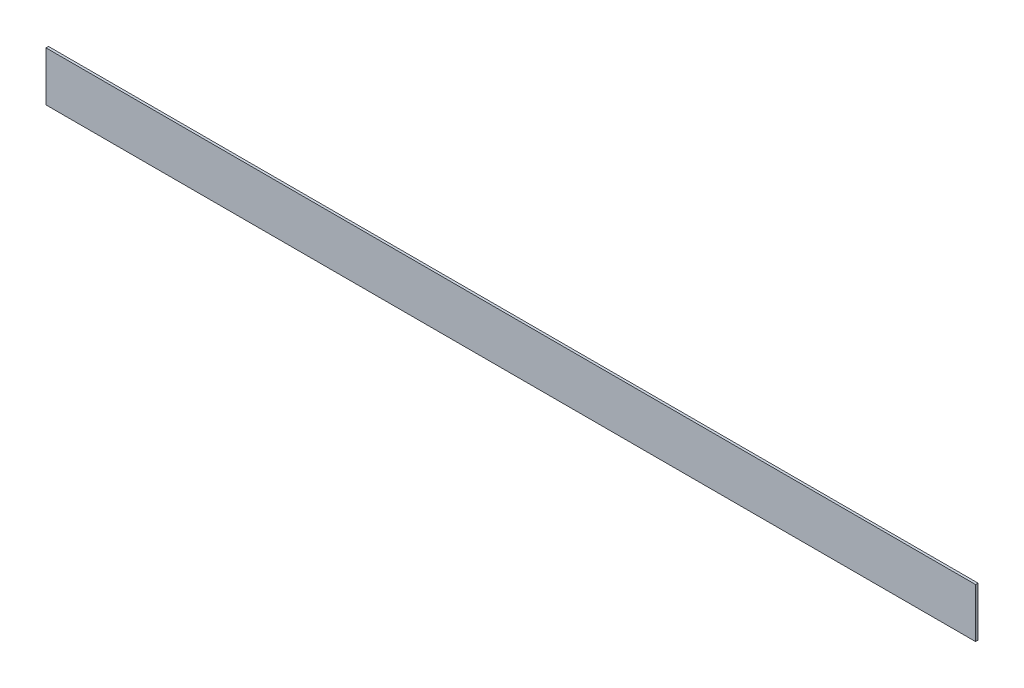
from build123d import *

# Parameters (mm, degrees)
SKETCH3_W           = 2387.6
SKETCH3_H           = 127
BOSS_EXTRUDE1_DEPTH = 6.35


with BuildPart() as part:
    # Sketch3 → Boss-Extrude1 (new body)
    with BuildSketch(Plane.XY):
        with Locations((1193.8, 63.5)):
            Rectangle(SKETCH3_W, SKETCH3_H)
    extrude(amount=BOSS_EXTRUDE1_DEPTH)


solid = part.part
